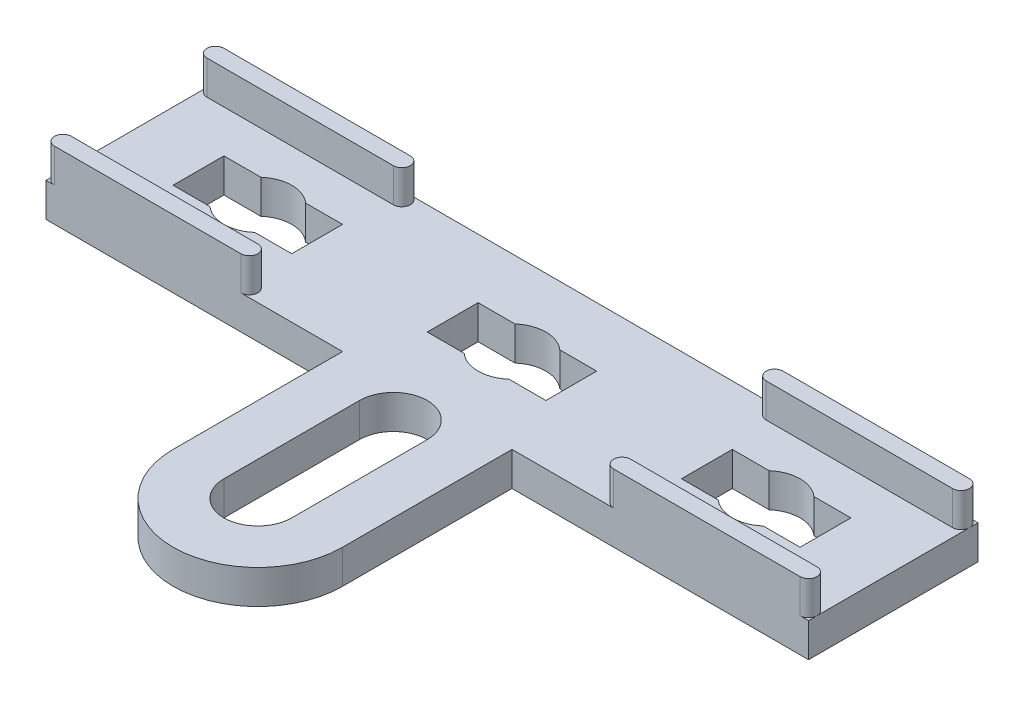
from build123d import *

# Parameters (mm, degrees)
EXTRUDE_1_DEPTH               = 2
EXTRUDE_2_DEPTH               = 2
PATTERN_LINEAR_1_COUNT        = 2
PATTERN_LINEAR_1_PITCH        = 33
PATTERN_LINEAR_1_COPY_1_DEPTH = 2
CUT_EXTRUDE_1_REACH           = 32.17
PATTERN_LINEAR_2_COUNT        = 2
PATTERN_LINEAR_2_PITCH        = 15
PATTERN_LINEAR_2_COL_COUNT    = 2
PATTERN_LINEAR_2_COL_PITCH    = 15
CUT_EXTRUDE_2_DEPTH           = 10


with BuildPart() as part:
    # Sketch 1 → Extrude 1 (new body)
    with BuildSketch(Plane(origin=(0, 0, 0), x_dir=(1, 0, 0), z_dir=(0, 1, 0))):
        with BuildLine():
            Line((22.5, 5), (22.5, -5))
            Line((22.5, -5), (5, -5))
            Line((5, -5), (5, -15))
            ThreePointArc((5, -15), (0, -20), (-5, -15))
            Line((-5, -15), (-5, -5))
            Line((-5, -5), (-22.5, -5))
            Line((-22.5, -5), (-22.5, 5))
            Line((-22.5, 5), (22.5, 5))
        make_face()
    extrude(amount=EXTRUDE_1_DEPTH)

    # Sketch 2 → Extrude 2 (add)
    with BuildSketch(Plane(origin=(0, 2, 0), x_dir=(1, 0, 0), z_dir=(0, 1, 0))):
        with BuildLine():
            Line((-22, 4), (-11, 4))
            ThreePointArc((-11, 4), (-10.5, 4.5), (-11, 5))
            Line((-11, 5), (-22, 5))
            ThreePointArc((-22, 5), (-22.5, 4.5), (-22, 4))
        make_face()
    extrude_2 = extrude(amount=EXTRUDE_2_DEPTH)

    # Mirror 1: Extrude 2 across plane
    add(extrude_2.mirror(Plane.XY))

    # Pattern Linear 1: Extrude 2 ×2
    with Locations(*[(i * PATTERN_LINEAR_1_PITCH, 0, 0) for i in range(1, PATTERN_LINEAR_1_COUNT)]):
        add(extrude_2)

    # Pattern Linear 1 copy 1 sketch → Pattern Linear 1 copy 1 (add)
    with BuildSketch(Plane(origin=(33, 2, 0), x_dir=(1, 0, 0), z_dir=(0, 1, 0))):
        with BuildLine():
            Line((-22, -4), (-11, -4))
            ThreePointArc((-11, -4), (-10.5, -4.5), (-11, -5))
            Line((-11, -5), (-22, -5))
            ThreePointArc((-22, -5), (-22.5, -4.5), (-22, -4))
        make_face()
    extrude(amount=PATTERN_LINEAR_1_COPY_1_DEPTH)

    # Sketch 4 → Cut-Extrude 1 (cut, up to next)
    with BuildSketch(Plane(origin=(0, 2, 0), x_dir=(1, 0, 0), z_dir=(0, 1, 0)), mode=Mode.PRIVATE) as cut_extrude_1_sk1:
        with BuildLine():
            Line((3.5, 1.5), (3.5, -1.5))
            Line((3.5, -1.5), (1.322875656, -1.5))
            ThreePointArc((1.322875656, -1.5), (0, -2), (-1.322875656, -1.5))
            Line((-1.322875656, -1.5), (-3.5, -1.5))
            Line((-3.5, -1.5), (-3.5, 1.5))
            Line((-3.5, 1.5), (-1.322875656, 1.5))
            ThreePointArc((-1.322875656, 1.5), (0, 2), (1.322875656, 1.5))
            Line((1.322875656, 1.5), (3.5, 1.5))
        make_face()
    cut_extrude_1_tool1 = extrude(cut_extrude_1_sk1.sketch, amount=-CUT_EXTRUDE_1_REACH, mode=Mode.PRIVATE) & part.part
    cut_extrude_1 = cut_extrude_1_tool1.solids().sort_by_distance((0, 2, 0))[0]
    add(cut_extrude_1, mode=Mode.SUBTRACT)

    # Pattern Linear 2: Cut-Extrude 1 ×2
    with Locations(*[(i * PATTERN_LINEAR_2_PITCH, 0, 0) for i in range(1, PATTERN_LINEAR_2_COUNT)]):
        add(cut_extrude_1, mode=Mode.SUBTRACT)

    # Pattern Linear 2 col: Cut-Extrude 1 ×2
    with Locations(*[(-i * PATTERN_LINEAR_2_COL_PITCH, 0, 0) for i in range(1, PATTERN_LINEAR_2_COL_COUNT)]):
        add(cut_extrude_1, mode=Mode.SUBTRACT)

    # Sketch 5 → Cut-Extrude 2 (cut)
    with BuildSketch(Plane(origin=(0, 2, 0), x_dir=(1, 0, 0), z_dir=(0, 1, 0))):
        with BuildLine():
            Line((-2, -7), (-2, -15))
            ThreePointArc((-2, -15), (0, -17), (2, -15))
            Line((2, -15), (2, -7))
            ThreePointArc((2, -7), (0, -5), (-2, -7))
        make_face()
    extrude(amount=-CUT_EXTRUDE_2_DEPTH, mode=Mode.SUBTRACT)


solid = part.part
